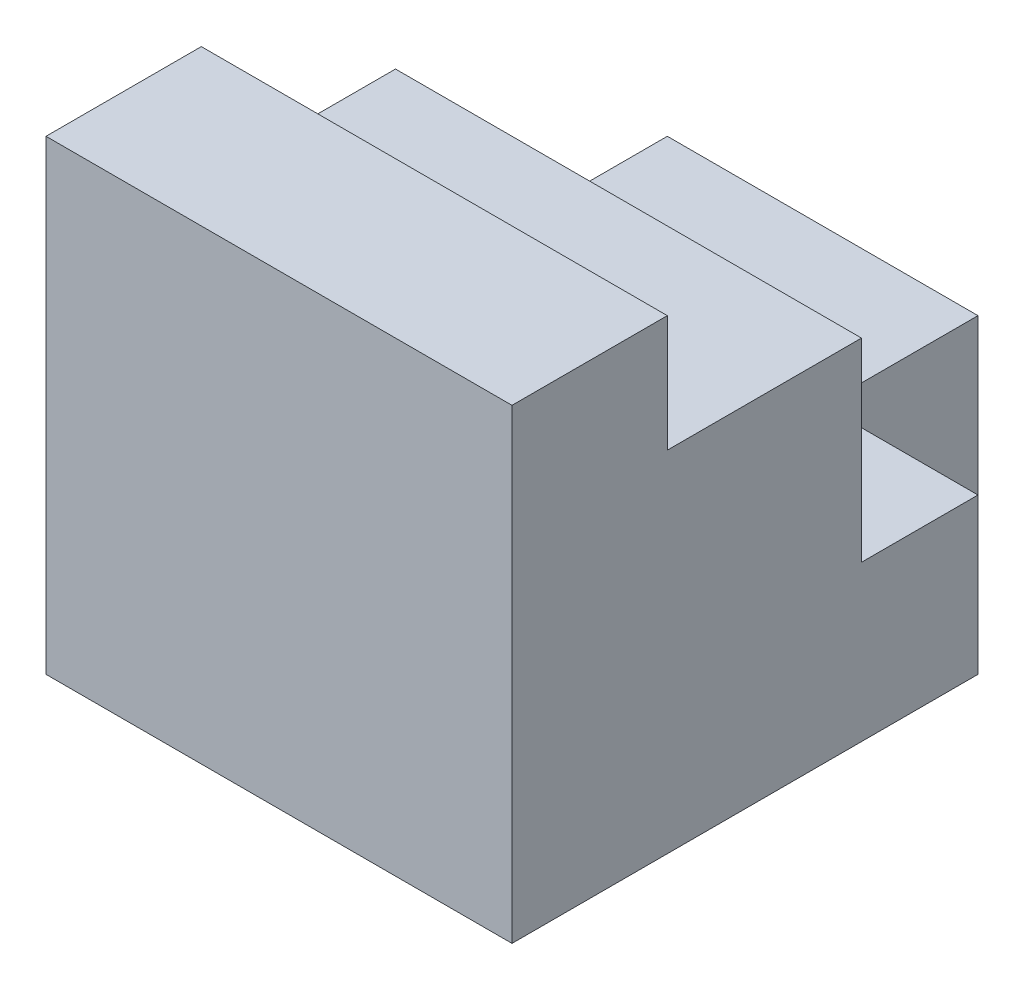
ISO-10303-21;
HEADER;
FILE_DESCRIPTION(('STEP AP214'),'2;1');
FILE_NAME('part.step','',(''),(''),'','','');
FILE_SCHEMA(('AUTOMOTIVE_DESIGN { 1 0 10303 214 1 1 1 1 }'));
ENDSEC;
DATA;
#1=APPLICATION_CONTEXT('core data for automotive mechanical design processes');
#2=APPLICATION_PROTOCOL_DEFINITION('international standard','automotive_design',2000,#1);
#3=PRODUCT_CONTEXT('',#1,'mechanical');
#4=PRODUCT('Part','Part','',(#3));
#5=PRODUCT_RELATED_PRODUCT_CATEGORY('part','',(#4));
#6=PRODUCT_DEFINITION_FORMATION('','',#4);
#7=PRODUCT_DEFINITION_CONTEXT('part definition',#1,'design');
#8=PRODUCT_DEFINITION('design','',#6,#7);
#9=PRODUCT_DEFINITION_SHAPE('','',#8);
#10=(LENGTH_UNIT() NAMED_UNIT(*) SI_UNIT(.MILLI.,.METRE.));
#11=(NAMED_UNIT(*) PLANE_ANGLE_UNIT() SI_UNIT($,.RADIAN.));
#12=(NAMED_UNIT(*) SI_UNIT($,.STERADIAN.) SOLID_ANGLE_UNIT());
#13=UNCERTAINTY_MEASURE_WITH_UNIT(LENGTH_MEASURE(1.E-05),#10,'distance_accuracy_value','');
#14=(GEOMETRIC_REPRESENTATION_CONTEXT(3) GLOBAL_UNCERTAINTY_ASSIGNED_CONTEXT((#13)) GLOBAL_UNIT_ASSIGNED_CONTEXT((#10,
#11,#12)) REPRESENTATION_CONTEXT('',''));
#15=CARTESIAN_POINT('',(0.,0.,0.));
#16=DIRECTION('',(0.,0.,1.));
#17=DIRECTION('',(1.,0.,0.));
#18=AXIS2_PLACEMENT_3D('',#15,#16,#17);
#19=CARTESIAN_POINT('',(60.,0.,-80.));
#20=DIRECTION('',(0.,1.,0.));
#21=DIRECTION('',(0.,0.,1.));
#22=AXIS2_PLACEMENT_3D('',#19,#20,#21);
#23=PLANE('',#22);
#24=DIRECTION('',(0.,0.,1.));
#25=VECTOR('',#24,1.);
#26=CARTESIAN_POINT('',(40.,0.,-80.));
#27=LINE('',#26,#25);
#28=CARTESIAN_POINT('',(40.,0.,-80.));
#29=VERTEX_POINT('',#28);
#30=CARTESIAN_POINT('',(40.,0.,-60.));
#31=VERTEX_POINT('',#30);
#32=EDGE_CURVE('E201',#29,#31,#27,.T.);
#33=ORIENTED_EDGE('',*,*,#32,.T.);
#34=DIRECTION('',(1.,0.,0.));
#35=VECTOR('',#34,1.);
#36=CARTESIAN_POINT('',(60.,0.,-60.));
#37=LINE('',#36,#35);
#38=CARTESIAN_POINT('',(60.,0.,-60.));
#39=VERTEX_POINT('',#38);
#40=EDGE_CURVE('E197',#31,#39,#37,.T.);
#41=ORIENTED_EDGE('',*,*,#40,.T.);
#42=DIRECTION('',(0.,0.,-1.));
#43=VECTOR('',#42,1.);
#44=CARTESIAN_POINT('',(60.,0.,-80.));
#45=LINE('',#44,#43);
#46=CARTESIAN_POINT('',(60.,0.,0.));
#47=VERTEX_POINT('',#46);
#48=EDGE_CURVE('E155',#47,#39,#45,.T.);
#49=ORIENTED_EDGE('',*,*,#48,.F.);
#50=DIRECTION('',(-1.,0.,0.));
#51=VECTOR('',#50,1.);
#52=CARTESIAN_POINT('',(60.,0.,0.));
#53=LINE('',#52,#51);
#54=CARTESIAN_POINT('',(0.,0.,0.));
#55=VERTEX_POINT('',#54);
#56=EDGE_CURVE('E134',#47,#55,#53,.T.);
#57=ORIENTED_EDGE('',*,*,#56,.T.);
#58=DIRECTION('',(0.,0.,-1.));
#59=VECTOR('',#58,1.);
#60=CARTESIAN_POINT('',(0.,0.,-80.));
#61=LINE('',#60,#59);
#62=CARTESIAN_POINT('',(0.,0.,-80.));
#63=VERTEX_POINT('',#62);
#64=EDGE_CURVE('E138',#55,#63,#61,.T.);
#65=ORIENTED_EDGE('',*,*,#64,.T.);
#66=DIRECTION('',(-1.,0.,0.));
#67=VECTOR('',#66,1.);
#68=CARTESIAN_POINT('',(60.,0.,-80.));
#69=LINE('',#68,#67);
#70=EDGE_CURVE('E11',#29,#63,#69,.T.);
#71=ORIENTED_EDGE('',*,*,#70,.F.);
#72=EDGE_LOOP('',(#33,#41,#49,#57,#65,#71));
#73=FACE_BOUND('',#72,.T.);
#74=ADVANCED_FACE('F37',(#73),#23,.F.);
#75=CARTESIAN_POINT('',(60.,20.,-80.));
#76=DIRECTION('',(0.,0.,1.));
#77=DIRECTION('',(1.,0.,0.));
#78=AXIS2_PLACEMENT_3D('',#75,#76,#77);
#79=PLANE('',#78);
#80=DIRECTION('',(-1.,0.,0.));
#81=VECTOR('',#80,1.);
#82=CARTESIAN_POINT('',(60.,20.,-80.));
#83=LINE('',#82,#81);
#84=CARTESIAN_POINT('',(40.,20.,-80.));
#85=VERTEX_POINT('',#84);
#86=CARTESIAN_POINT('',(0.,20.,-80.));
#87=VERTEX_POINT('',#86);
#88=EDGE_CURVE('E44',#85,#87,#83,.T.);
#89=ORIENTED_EDGE('',*,*,#88,.F.);
#90=DIRECTION('',(0.,1.,0.));
#91=VECTOR('',#90,1.);
#92=CARTESIAN_POINT('',(40.,0.,-80.));
#93=LINE('',#92,#91);
#94=EDGE_CURVE('E193',#29,#85,#93,.T.);
#95=ORIENTED_EDGE('',*,*,#94,.F.);
#96=ORIENTED_EDGE('',*,*,#70,.T.);
#97=DIRECTION('',(0.,1.,0.));
#98=VECTOR('',#97,1.);
#99=CARTESIAN_POINT('',(0.,20.,-80.));
#100=LINE('',#99,#98);
#101=EDGE_CURVE('E141',#63,#87,#100,.T.);
#102=ORIENTED_EDGE('',*,*,#101,.T.);
#103=EDGE_LOOP('',(#89,#95,#96,#102));
#104=FACE_BOUND('',#103,.T.);
#105=ADVANCED_FACE('F175',(#104),#79,.F.);
#106=CARTESIAN_POINT('',(60.,20.,-45.));
#107=DIRECTION('',(0.,-1.,0.));
#108=DIRECTION('',(0.,0.,-1.));
#109=AXIS2_PLACEMENT_3D('',#106,#107,#108);
#110=PLANE('',#109);
#111=DIRECTION('',(0.,0.,1.));
#112=VECTOR('',#111,1.);
#113=CARTESIAN_POINT('',(60.,20.,-45.));
#114=LINE('',#113,#112);
#115=CARTESIAN_POINT('',(60.,20.,-60.));
#116=VERTEX_POINT('',#115);
#117=CARTESIAN_POINT('',(60.,20.,-45.));
#118=VERTEX_POINT('',#117);
#119=EDGE_CURVE('E99',#116,#118,#114,.T.);
#120=ORIENTED_EDGE('',*,*,#119,.F.);
#121=DIRECTION('',(1.,0.,0.));
#122=VECTOR('',#121,1.);
#123=CARTESIAN_POINT('',(60.,20.,-60.));
#124=LINE('',#123,#122);
#125=CARTESIAN_POINT('',(40.,20.,-60.));
#126=VERTEX_POINT('',#125);
#127=EDGE_CURVE('E51',#126,#116,#124,.T.);
#128=ORIENTED_EDGE('',*,*,#127,.F.);
#129=DIRECTION('',(0.,0.,1.));
#130=VECTOR('',#129,1.);
#131=CARTESIAN_POINT('',(40.,20.,-80.));
#132=LINE('',#131,#130);
#133=EDGE_CURVE('E171',#85,#126,#132,.T.);
#134=ORIENTED_EDGE('',*,*,#133,.F.);
#135=ORIENTED_EDGE('',*,*,#88,.T.);
#136=DIRECTION('',(0.,0.,1.));
#137=VECTOR('',#136,1.);
#138=CARTESIAN_POINT('',(0.,20.,-45.));
#139=LINE('',#138,#137);
#140=CARTESIAN_POINT('',(0.,20.,-45.));
#141=VERTEX_POINT('',#140);
#142=EDGE_CURVE('E145',#87,#141,#139,.T.);
#143=ORIENTED_EDGE('',*,*,#142,.T.);
#144=DIRECTION('',(-1.,0.,0.));
#145=VECTOR('',#144,1.);
#146=CARTESIAN_POINT('',(60.,20.,-45.));
#147=LINE('',#146,#145);
#148=EDGE_CURVE('E162',#118,#141,#147,.T.);
#149=ORIENTED_EDGE('',*,*,#148,.F.);
#150=EDGE_LOOP('',(#120,#128,#134,#135,#143,#149));
#151=FACE_BOUND('',#150,.T.);
#152=ADVANCED_FACE('F167',(#151),#110,.F.);
#153=CARTESIAN_POINT('',(60.,45.,-45.));
#154=DIRECTION('',(0.,0.,1.));
#155=DIRECTION('',(0.,-1.,0.));
#156=AXIS2_PLACEMENT_3D('',#153,#154,#155);
#157=PLANE('',#156);
#158=DIRECTION('',(0.,1.,0.));
#159=VECTOR('',#158,1.);
#160=CARTESIAN_POINT('',(0.,45.,-45.));
#161=LINE('',#160,#159);
#162=CARTESIAN_POINT('',(0.,45.,-45.));
#163=VERTEX_POINT('',#162);
#164=EDGE_CURVE('E147',#141,#163,#161,.T.);
#165=ORIENTED_EDGE('',*,*,#164,.T.);
#166=DIRECTION('',(-1.,0.,0.));
#167=VECTOR('',#166,1.);
#168=CARTESIAN_POINT('',(60.,45.,-45.));
#169=LINE('',#168,#167);
#170=CARTESIAN_POINT('',(60.,45.,-45.));
#171=VERTEX_POINT('',#170);
#172=EDGE_CURVE('E159',#171,#163,#169,.T.);
#173=ORIENTED_EDGE('',*,*,#172,.F.);
#174=DIRECTION('',(0.,1.,0.));
#175=VECTOR('',#174,1.);
#176=CARTESIAN_POINT('',(60.,45.,-45.));
#177=LINE('',#176,#175);
#178=EDGE_CURVE('E188',#118,#171,#177,.T.);
#179=ORIENTED_EDGE('',*,*,#178,.F.);
#180=ORIENTED_EDGE('',*,*,#148,.T.);
#181=EDGE_LOOP('',(#165,#173,#179,#180));
#182=FACE_BOUND('',#181,.T.);
#183=ADVANCED_FACE('F184',(#182),#157,.F.);
#184=CARTESIAN_POINT('',(60.,45.,-20.));
#185=DIRECTION('',(0.,-1.,0.));
#186=DIRECTION('',(0.,0.,-1.));
#187=AXIS2_PLACEMENT_3D('',#184,#185,#186);
#188=PLANE('',#187);
#189=DIRECTION('',(0.,0.,1.));
#190=VECTOR('',#189,1.);
#191=CARTESIAN_POINT('',(0.,45.,-20.));
#192=LINE('',#191,#190);
#193=CARTESIAN_POINT('',(0.,45.,-20.));
#194=VERTEX_POINT('',#193);
#195=EDGE_CURVE('E149',#163,#194,#192,.T.);
#196=ORIENTED_EDGE('',*,*,#195,.T.);
#197=DIRECTION('',(-1.,0.,0.));
#198=VECTOR('',#197,1.);
#199=CARTESIAN_POINT('',(60.,45.,-20.));
#200=LINE('',#199,#198);
#201=CARTESIAN_POINT('',(60.,45.,-20.));
#202=VERTEX_POINT('',#201);
#203=EDGE_CURVE('E129',#202,#194,#200,.T.);
#204=ORIENTED_EDGE('',*,*,#203,.F.);
#205=DIRECTION('',(0.,0.,1.));
#206=VECTOR('',#205,1.);
#207=CARTESIAN_POINT('',(60.,45.,-20.));
#208=LINE('',#207,#206);
#209=EDGE_CURVE('E117',#171,#202,#208,.T.);
#210=ORIENTED_EDGE('',*,*,#209,.F.);
#211=ORIENTED_EDGE('',*,*,#172,.T.);
#212=EDGE_LOOP('',(#196,#204,#210,#211));
#213=FACE_BOUND('',#212,.T.);
#214=ADVANCED_FACE('F187',(#213),#188,.F.);
#215=CARTESIAN_POINT('',(60.,60.,-20.));
#216=DIRECTION('',(0.,0.,1.));
#217=DIRECTION('',(0.,-1.,0.));
#218=AXIS2_PLACEMENT_3D('',#215,#216,#217);
#219=PLANE('',#218);
#220=DIRECTION('',(0.,1.,0.));
#221=VECTOR('',#220,1.);
#222=CARTESIAN_POINT('',(0.,60.,-20.));
#223=LINE('',#222,#221);
#224=CARTESIAN_POINT('',(0.,60.,-20.));
#225=VERTEX_POINT('',#224);
#226=EDGE_CURVE('E126',#194,#225,#223,.T.);
#227=ORIENTED_EDGE('',*,*,#226,.T.);
#228=DIRECTION('',(-1.,0.,0.));
#229=VECTOR('',#228,1.);
#230=CARTESIAN_POINT('',(60.,60.,-20.));
#231=LINE('',#230,#229);
#232=CARTESIAN_POINT('',(60.,60.,-20.));
#233=VERTEX_POINT('',#232);
#234=EDGE_CURVE('E123',#233,#225,#231,.T.);
#235=ORIENTED_EDGE('',*,*,#234,.F.);
#236=DIRECTION('',(0.,1.,0.));
#237=VECTOR('',#236,1.);
#238=CARTESIAN_POINT('',(60.,60.,-20.));
#239=LINE('',#238,#237);
#240=EDGE_CURVE('E110',#202,#233,#239,.T.);
#241=ORIENTED_EDGE('',*,*,#240,.F.);
#242=ORIENTED_EDGE('',*,*,#203,.T.);
#243=EDGE_LOOP('',(#227,#235,#241,#242));
#244=FACE_BOUND('',#243,.T.);
#245=ADVANCED_FACE('F124',(#244),#219,.F.);
#246=CARTESIAN_POINT('',(60.,60.,0.));
#247=DIRECTION('',(0.,-1.,0.));
#248=DIRECTION('',(0.,0.,-1.));
#249=AXIS2_PLACEMENT_3D('',#246,#247,#248);
#250=PLANE('',#249);
#251=DIRECTION('',(0.,0.,1.));
#252=VECTOR('',#251,1.);
#253=CARTESIAN_POINT('',(0.,60.,0.));
#254=LINE('',#253,#252);
#255=CARTESIAN_POINT('',(0.,60.,0.));
#256=VERTEX_POINT('',#255);
#257=EDGE_CURVE('E152',#225,#256,#254,.T.);
#258=ORIENTED_EDGE('',*,*,#257,.T.);
#259=DIRECTION('',(-1.,0.,0.));
#260=VECTOR('',#259,1.);
#261=CARTESIAN_POINT('',(60.,60.,0.));
#262=LINE('',#261,#260);
#263=CARTESIAN_POINT('',(60.,60.,0.));
#264=VERTEX_POINT('',#263);
#265=EDGE_CURVE('E130',#264,#256,#262,.T.);
#266=ORIENTED_EDGE('',*,*,#265,.F.);
#267=DIRECTION('',(0.,0.,1.));
#268=VECTOR('',#267,1.);
#269=CARTESIAN_POINT('',(60.,60.,0.));
#270=LINE('',#269,#268);
#271=EDGE_CURVE('E114',#233,#264,#270,.T.);
#272=ORIENTED_EDGE('',*,*,#271,.F.);
#273=ORIENTED_EDGE('',*,*,#234,.T.);
#274=EDGE_LOOP('',(#258,#266,#272,#273));
#275=FACE_BOUND('',#274,.T.);
#276=ADVANCED_FACE('F132',(#275),#250,.F.);
#277=CARTESIAN_POINT('',(60.,0.,0.));
#278=DIRECTION('',(0.,0.,-1.));
#279=DIRECTION('',(-1.,0.,0.));
#280=AXIS2_PLACEMENT_3D('',#277,#278,#279);
#281=PLANE('',#280);
#282=DIRECTION('',(0.,-1.,0.));
#283=VECTOR('',#282,1.);
#284=CARTESIAN_POINT('',(0.,0.,0.));
#285=LINE('',#284,#283);
#286=EDGE_CURVE('E92',#256,#55,#285,.T.);
#287=ORIENTED_EDGE('',*,*,#286,.T.);
#288=ORIENTED_EDGE('',*,*,#56,.F.);
#289=DIRECTION('',(0.,-1.,0.));
#290=VECTOR('',#289,1.);
#291=CARTESIAN_POINT('',(60.,0.,0.));
#292=LINE('',#291,#290);
#293=EDGE_CURVE('E60',#264,#47,#292,.T.);
#294=ORIENTED_EDGE('',*,*,#293,.F.);
#295=ORIENTED_EDGE('',*,*,#265,.T.);
#296=EDGE_LOOP('',(#287,#288,#294,#295));
#297=FACE_BOUND('',#296,.T.);
#298=ADVANCED_FACE('F219',(#297),#281,.F.);
#299=CARTESIAN_POINT('',(60.,0.,0.));
#300=DIRECTION('',(-1.,0.,0.));
#301=DIRECTION('',(0.,0.,1.));
#302=AXIS2_PLACEMENT_3D('',#299,#300,#301);
#303=PLANE('',#302);
#304=ORIENTED_EDGE('',*,*,#48,.T.);
#305=DIRECTION('',(0.,1.,0.));
#306=VECTOR('',#305,1.);
#307=CARTESIAN_POINT('',(60.,0.,-60.));
#308=LINE('',#307,#306);
#309=EDGE_CURVE('E142',#39,#116,#308,.T.);
#310=ORIENTED_EDGE('',*,*,#309,.T.);
#311=ORIENTED_EDGE('',*,*,#119,.T.);
#312=ORIENTED_EDGE('',*,*,#178,.T.);
#313=ORIENTED_EDGE('',*,*,#209,.T.);
#314=ORIENTED_EDGE('',*,*,#240,.T.);
#315=ORIENTED_EDGE('',*,*,#271,.T.);
#316=ORIENTED_EDGE('',*,*,#293,.T.);
#317=EDGE_LOOP('',(#304,#310,#311,#312,#313,#314,#315,#316));
#318=FACE_BOUND('',#317,.T.);
#319=ADVANCED_FACE('F112',(#318),#303,.F.);
#320=CARTESIAN_POINT('',(0.,0.,0.));
#321=DIRECTION('',(-1.,0.,0.));
#322=DIRECTION('',(0.,0.,1.));
#323=AXIS2_PLACEMENT_3D('',#320,#321,#322);
#324=PLANE('',#323);
#325=ORIENTED_EDGE('',*,*,#64,.F.);
#326=ORIENTED_EDGE('',*,*,#286,.F.);
#327=ORIENTED_EDGE('',*,*,#257,.F.);
#328=ORIENTED_EDGE('',*,*,#226,.F.);
#329=ORIENTED_EDGE('',*,*,#195,.F.);
#330=ORIENTED_EDGE('',*,*,#164,.F.);
#331=ORIENTED_EDGE('',*,*,#142,.F.);
#332=ORIENTED_EDGE('',*,*,#101,.F.);
#333=EDGE_LOOP('',(#325,#326,#327,#328,#329,#330,#331,#332));
#334=FACE_BOUND('',#333,.T.);
#335=ADVANCED_FACE('F180',(#334),#324,.T.);
#336=CARTESIAN_POINT('',(60.,0.,-60.));
#337=DIRECTION('',(0.,0.,1.));
#338=DIRECTION('',(1.,0.,0.));
#339=AXIS2_PLACEMENT_3D('',#336,#337,#338);
#340=PLANE('',#339);
#341=ORIENTED_EDGE('',*,*,#127,.T.);
#342=ORIENTED_EDGE('',*,*,#309,.F.);
#343=ORIENTED_EDGE('',*,*,#40,.F.);
#344=DIRECTION('',(0.,1.,0.));
#345=VECTOR('',#344,1.);
#346=CARTESIAN_POINT('',(40.,0.,-60.));
#347=LINE('',#346,#345);
#348=EDGE_CURVE('E196',#31,#126,#347,.T.);
#349=ORIENTED_EDGE('',*,*,#348,.T.);
#350=EDGE_LOOP('',(#341,#342,#343,#349));
#351=FACE_BOUND('',#350,.T.);
#352=ADVANCED_FACE('F218',(#351),#340,.F.);
#353=CARTESIAN_POINT('',(40.,0.,-80.));
#354=DIRECTION('',(-1.,0.,0.));
#355=DIRECTION('',(0.,0.,1.));
#356=AXIS2_PLACEMENT_3D('',#353,#354,#355);
#357=PLANE('',#356);
#358=ORIENTED_EDGE('',*,*,#133,.T.);
#359=ORIENTED_EDGE('',*,*,#348,.F.);
#360=ORIENTED_EDGE('',*,*,#32,.F.);
#361=ORIENTED_EDGE('',*,*,#94,.T.);
#362=EDGE_LOOP('',(#358,#359,#360,#361));
#363=FACE_BOUND('',#362,.T.);
#364=ADVANCED_FACE('F215',(#363),#357,.F.);
#365=CLOSED_SHELL('',(#74,#105,#152,#183,#214,#245,#276,#298,#319,#335,#352,#364));
#366=MANIFOLD_SOLID_BREP('B2',#365);
#367=ADVANCED_BREP_SHAPE_REPRESENTATION('',(#18,#366),#14);
#368=SHAPE_DEFINITION_REPRESENTATION(#9,#367);
ENDSEC;
END-ISO-10303-21;
